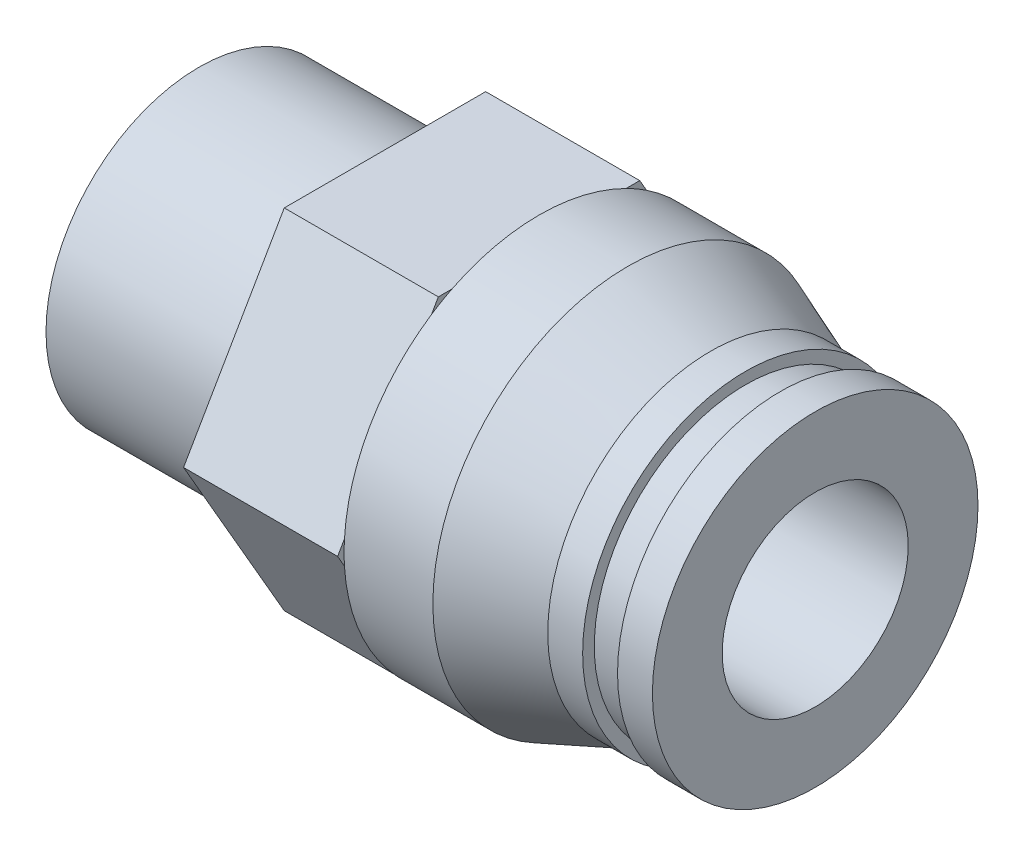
ISO-10303-21;
HEADER;
FILE_DESCRIPTION(('STEP AP214'),'2;1');
FILE_NAME('part.step','',(''),(''),'','','');
FILE_SCHEMA(('AUTOMOTIVE_DESIGN { 1 0 10303 214 1 1 1 1 }'));
ENDSEC;
DATA;
#1=APPLICATION_CONTEXT('core data for automotive mechanical design processes');
#2=APPLICATION_PROTOCOL_DEFINITION('international standard','automotive_design',2000,#1);
#3=PRODUCT_CONTEXT('',#1,'mechanical');
#4=PRODUCT('Part','Part','',(#3));
#5=PRODUCT_RELATED_PRODUCT_CATEGORY('part','',(#4));
#6=PRODUCT_DEFINITION_FORMATION('','',#4);
#7=PRODUCT_DEFINITION_CONTEXT('part definition',#1,'design');
#8=PRODUCT_DEFINITION('design','',#6,#7);
#9=PRODUCT_DEFINITION_SHAPE('','',#8);
#10=(LENGTH_UNIT() NAMED_UNIT(*) SI_UNIT(.MILLI.,.METRE.));
#11=(NAMED_UNIT(*) PLANE_ANGLE_UNIT() SI_UNIT($,.RADIAN.));
#12=(NAMED_UNIT(*) SI_UNIT($,.STERADIAN.) SOLID_ANGLE_UNIT());
#13=UNCERTAINTY_MEASURE_WITH_UNIT(LENGTH_MEASURE(1.E-05),#10,'distance_accuracy_value','');
#14=(GEOMETRIC_REPRESENTATION_CONTEXT(3) GLOBAL_UNCERTAINTY_ASSIGNED_CONTEXT((#13)) GLOBAL_UNIT_ASSIGNED_CONTEXT((#10,
#11,#12)) REPRESENTATION_CONTEXT('',''));
#15=CARTESIAN_POINT('',(0.,0.,0.));
#16=DIRECTION('',(0.,0.,1.));
#17=DIRECTION('',(1.,0.,0.));
#18=AXIS2_PLACEMENT_3D('',#15,#16,#17);
#19=CARTESIAN_POINT('',(8.,6.575,0.));
#20=DIRECTION('',(-1.,0.,0.));
#21=DIRECTION('',(0.,0.,1.));
#22=AXIS2_PLACEMENT_3D('',#19,#20,#21);
#23=PLANE('',#22);
#24=CARTESIAN_POINT('',(8.,0.,0.));
#25=DIRECTION('',(1.,0.,0.));
#26=DIRECTION('',(0.,0.,-1.));
#27=AXIS2_PLACEMENT_3D('',#24,#25,#26);
#28=CIRCLE('',#27,6.575);
#29=CARTESIAN_POINT('',(8.,0.,-6.575));
#30=VERTEX_POINT('',#29);
#31=EDGE_CURVE('E270',#30,#30,#28,.T.);
#32=ORIENTED_EDGE('',*,*,#31,.T.);
#33=EDGE_LOOP('',(#32));
#34=FACE_BOUND('',#33,.T.);
#35=DIRECTION('',(0.,-0.866025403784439,0.5));
#36=VECTOR('',#35,1.);
#37=CARTESIAN_POINT('',(8.,0.,-8.66025403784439));
#38=LINE('',#37,#36);
#39=CARTESIAN_POINT('',(8.,0.,-8.66025403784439));
#40=VERTEX_POINT('',#39);
#41=CARTESIAN_POINT('',(8.,-7.5,-4.33012701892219));
#42=VERTEX_POINT('',#41);
#43=EDGE_CURVE('E164',#40,#42,#38,.T.);
#44=ORIENTED_EDGE('',*,*,#43,.T.);
#45=DIRECTION('',(0.,0.,1.));
#46=VECTOR('',#45,1.);
#47=CARTESIAN_POINT('',(8.,-7.5,-4.33012701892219));
#48=LINE('',#47,#46);
#49=CARTESIAN_POINT('',(8.,-7.5,4.3301270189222));
#50=VERTEX_POINT('',#49);
#51=EDGE_CURVE('E146',#42,#50,#48,.T.);
#52=ORIENTED_EDGE('',*,*,#51,.T.);
#53=DIRECTION('',(0.,0.866025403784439,0.5));
#54=VECTOR('',#53,1.);
#55=CARTESIAN_POINT('',(8.,-7.5,4.3301270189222));
#56=LINE('',#55,#54);
#57=CARTESIAN_POINT('',(8.,0.,8.66025403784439));
#58=VERTEX_POINT('',#57);
#59=EDGE_CURVE('E158',#50,#58,#56,.T.);
#60=ORIENTED_EDGE('',*,*,#59,.T.);
#61=DIRECTION('',(0.,0.866025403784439,-0.5));
#62=VECTOR('',#61,1.);
#63=CARTESIAN_POINT('',(8.,0.,8.66025403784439));
#64=LINE('',#63,#62);
#65=CARTESIAN_POINT('',(8.,7.5,4.33012701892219));
#66=VERTEX_POINT('',#65);
#67=EDGE_CURVE('E30',#58,#66,#64,.T.);
#68=ORIENTED_EDGE('',*,*,#67,.T.);
#69=DIRECTION('',(0.,0.,-1.));
#70=VECTOR('',#69,1.);
#71=CARTESIAN_POINT('',(8.,7.5,4.33012701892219));
#72=LINE('',#71,#70);
#73=CARTESIAN_POINT('',(8.,7.5,-4.3301270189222));
#74=VERTEX_POINT('',#73);
#75=EDGE_CURVE('E168',#66,#74,#72,.T.);
#76=ORIENTED_EDGE('',*,*,#75,.T.);
#77=DIRECTION('',(0.,-0.866025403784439,-0.5));
#78=VECTOR('',#77,1.);
#79=CARTESIAN_POINT('',(8.,7.5,-4.3301270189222));
#80=LINE('',#79,#78);
#81=EDGE_CURVE('E171',#74,#40,#80,.T.);
#82=ORIENTED_EDGE('',*,*,#81,.T.);
#83=EDGE_LOOP('',(#44,#52,#60,#68,#76,#82));
#84=FACE_BOUND('',#83,.T.);
#85=ADVANCED_FACE('F15',(#34,#84),#23,.T.);
#86=CARTESIAN_POINT('',(14.625,9.5,0.));
#87=DIRECTION('',(1.,0.,0.));
#88=DIRECTION('',(0.,0.,-1.));
#89=AXIS2_PLACEMENT_3D('',#86,#87,#88);
#90=PLANE('',#89);
#91=CARTESIAN_POINT('',(14.625,0.,0.));
#92=DIRECTION('',(1.,0.,0.));
#93=DIRECTION('',(0.,0.,-1.));
#94=AXIS2_PLACEMENT_3D('',#91,#92,#93);
#95=CIRCLE('',#94,8.38207981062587);
#96=CARTESIAN_POINT('',(14.625,-7.5,-3.7428948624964));
#97=VERTEX_POINT('',#96);
#98=CARTESIAN_POINT('',(14.625,-6.99144203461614,-4.62374309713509));
#99=VERTEX_POINT('',#98);
#100=EDGE_CURVE('E381',#97,#99,#95,.T.);
#101=ORIENTED_EDGE('',*,*,#100,.F.);
#102=DIRECTION('',(0.,0.,1.));
#103=VECTOR('',#102,1.);
#104=CARTESIAN_POINT('',(14.625,-7.5,-4.33012701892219));
#105=LINE('',#104,#103);
#106=CARTESIAN_POINT('',(14.625,-7.5,-4.33012701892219));
#107=VERTEX_POINT('',#106);
#108=EDGE_CURVE('E174',#107,#97,#105,.T.);
#109=ORIENTED_EDGE('',*,*,#108,.F.);
#110=DIRECTION('',(0.,-0.866025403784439,0.5));
#111=VECTOR('',#110,1.);
#112=CARTESIAN_POINT('',(14.625,0.,-8.66025403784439));
#113=LINE('',#112,#111);
#114=EDGE_CURVE('E194',#99,#107,#113,.T.);
#115=ORIENTED_EDGE('',*,*,#114,.F.);
#116=EDGE_LOOP('',(#101,#109,#115));
#117=FACE_BOUND('',#116,.T.);
#118=ADVANCED_FACE('F325',(#117),#90,.T.);
#119=CARTESIAN_POINT('',(14.625,-0.508557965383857,-8.36663795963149));
#120=VERTEX_POINT('',#119);
#121=CARTESIAN_POINT('',(14.625,0.50855796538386,-8.36663795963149));
#122=VERTEX_POINT('',#121);
#123=EDGE_CURVE('E266',#120,#122,#95,.T.);
#124=ORIENTED_EDGE('',*,*,#123,.F.);
#125=CARTESIAN_POINT('',(14.625,0.,-8.66025403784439));
#126=VERTEX_POINT('',#125);
#127=EDGE_CURVE('E155',#126,#120,#113,.T.);
#128=ORIENTED_EDGE('',*,*,#127,.F.);
#129=DIRECTION('',(0.,-0.866025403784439,-0.5));
#130=VECTOR('',#129,1.);
#131=CARTESIAN_POINT('',(14.625,7.5,-4.3301270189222));
#132=LINE('',#131,#130);
#133=EDGE_CURVE('E189',#122,#126,#132,.T.);
#134=ORIENTED_EDGE('',*,*,#133,.F.);
#135=EDGE_LOOP('',(#124,#128,#134));
#136=FACE_BOUND('',#135,.T.);
#137=ADVANCED_FACE('F331',(#136),#90,.T.);
#138=CARTESIAN_POINT('',(14.625,6.99144203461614,-4.62374309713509));
#139=VERTEX_POINT('',#138);
#140=CARTESIAN_POINT('',(14.625,7.5,-3.74289486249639));
#141=VERTEX_POINT('',#140);
#142=EDGE_CURVE('E271',#139,#141,#95,.T.);
#143=ORIENTED_EDGE('',*,*,#142,.F.);
#144=CARTESIAN_POINT('',(14.625,7.5,-4.3301270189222));
#145=VERTEX_POINT('',#144);
#146=EDGE_CURVE('E191',#145,#139,#132,.T.);
#147=ORIENTED_EDGE('',*,*,#146,.F.);
#148=DIRECTION('',(0.,0.,-1.));
#149=VECTOR('',#148,1.);
#150=CARTESIAN_POINT('',(14.625,7.5,4.33012701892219));
#151=LINE('',#150,#149);
#152=EDGE_CURVE('E184',#141,#145,#151,.T.);
#153=ORIENTED_EDGE('',*,*,#152,.F.);
#154=EDGE_LOOP('',(#143,#147,#153));
#155=FACE_BOUND('',#154,.T.);
#156=ADVANCED_FACE('F443',(#155),#90,.T.);
#157=CARTESIAN_POINT('',(14.625,7.5,3.74289486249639));
#158=VERTEX_POINT('',#157);
#159=CARTESIAN_POINT('',(14.625,6.99144203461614,4.62374309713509));
#160=VERTEX_POINT('',#159);
#161=EDGE_CURVE('E378',#158,#160,#95,.T.);
#162=ORIENTED_EDGE('',*,*,#161,.F.);
#163=CARTESIAN_POINT('',(14.625,7.5,4.33012701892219));
#164=VERTEX_POINT('',#163);
#165=EDGE_CURVE('E186',#164,#158,#151,.T.);
#166=ORIENTED_EDGE('',*,*,#165,.F.);
#167=DIRECTION('',(0.,0.866025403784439,-0.5));
#168=VECTOR('',#167,1.);
#169=CARTESIAN_POINT('',(14.625,0.,8.66025403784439));
#170=LINE('',#169,#168);
#171=EDGE_CURVE('E181',#160,#164,#170,.T.);
#172=ORIENTED_EDGE('',*,*,#171,.F.);
#173=EDGE_LOOP('',(#162,#166,#172));
#174=FACE_BOUND('',#173,.T.);
#175=ADVANCED_FACE('F361',(#174),#90,.T.);
#176=CARTESIAN_POINT('',(14.625,0.508557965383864,8.36663795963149));
#177=VERTEX_POINT('',#176);
#178=CARTESIAN_POINT('',(14.625,-0.508557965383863,8.36663795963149));
#179=VERTEX_POINT('',#178);
#180=EDGE_CURVE('E372',#177,#179,#95,.T.);
#181=ORIENTED_EDGE('',*,*,#180,.F.);
#182=CARTESIAN_POINT('',(14.625,0.,8.66025403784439));
#183=VERTEX_POINT('',#182);
#184=EDGE_CURVE('E36',#183,#177,#170,.T.);
#185=ORIENTED_EDGE('',*,*,#184,.F.);
#186=DIRECTION('',(0.,0.866025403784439,0.5));
#187=VECTOR('',#186,1.);
#188=CARTESIAN_POINT('',(14.625,-7.5,4.3301270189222));
#189=LINE('',#188,#187);
#190=EDGE_CURVE('E177',#179,#183,#189,.T.);
#191=ORIENTED_EDGE('',*,*,#190,.F.);
#192=EDGE_LOOP('',(#181,#185,#191));
#193=FACE_BOUND('',#192,.T.);
#194=ADVANCED_FACE('F356',(#193),#90,.T.);
#195=CARTESIAN_POINT('',(14.625,-7.5,4.3301270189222));
#196=VERTEX_POINT('',#195);
#197=CARTESIAN_POINT('',(14.625,-6.99144203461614,4.62374309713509));
#198=VERTEX_POINT('',#197);
#199=EDGE_CURVE('E179',#196,#198,#189,.T.);
#200=ORIENTED_EDGE('',*,*,#199,.F.);
#201=CARTESIAN_POINT('',(14.625,-7.5,3.74289486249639));
#202=VERTEX_POINT('',#201);
#203=EDGE_CURVE('E150',#202,#196,#105,.T.);
#204=ORIENTED_EDGE('',*,*,#203,.F.);
#205=EDGE_CURVE('E365',#198,#202,#95,.T.);
#206=ORIENTED_EDGE('',*,*,#205,.F.);
#207=EDGE_LOOP('',(#200,#204,#206));
#208=FACE_BOUND('',#207,.T.);
#209=ADVANCED_FACE('F334',(#208),#90,.T.);
#210=CARTESIAN_POINT('',(0.,0.,0.));
#211=DIRECTION('',(-1.,0.,0.));
#212=DIRECTION('',(0.,0.,1.));
#213=AXIS2_PLACEMENT_3D('',#210,#211,#212);
#214=PLANE('',#213);
#215=CARTESIAN_POINT('',(0.,0.,0.));
#216=DIRECTION('',(1.,0.,0.));
#217=DIRECTION('',(0.,0.,-1.));
#218=AXIS2_PLACEMENT_3D('',#215,#216,#217);
#219=CIRCLE('',#218,6.575);
#220=CARTESIAN_POINT('',(0.,0.,-6.575));
#221=VERTEX_POINT('',#220);
#222=EDGE_CURVE('E274',#221,#221,#219,.T.);
#223=ORIENTED_EDGE('',*,*,#222,.F.);
#224=EDGE_LOOP('',(#223));
#225=FACE_BOUND('',#224,.T.);
#226=DIRECTION('',(0.,-0.866025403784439,-0.5));
#227=VECTOR('',#226,1.);
#228=CARTESIAN_POINT('',(0.,0.,3.46410161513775));
#229=LINE('',#228,#227);
#230=CARTESIAN_POINT('',(0.,0.,3.46410161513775));
#231=VERTEX_POINT('',#230);
#232=CARTESIAN_POINT('',(0.,-3.,1.73205080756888));
#233=VERTEX_POINT('',#232);
#234=EDGE_CURVE('E223',#231,#233,#229,.T.);
#235=ORIENTED_EDGE('',*,*,#234,.T.);
#236=DIRECTION('',(0.,0.,-1.));
#237=VECTOR('',#236,1.);
#238=CARTESIAN_POINT('',(0.,-3.,1.73205080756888));
#239=LINE('',#238,#237);
#240=CARTESIAN_POINT('',(0.,-3.,-1.73205080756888));
#241=VERTEX_POINT('',#240);
#242=EDGE_CURVE('E201',#233,#241,#239,.T.);
#243=ORIENTED_EDGE('',*,*,#242,.T.);
#244=DIRECTION('',(0.,0.866025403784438,-0.5));
#245=VECTOR('',#244,1.);
#246=CARTESIAN_POINT('',(0.,-3.,-1.73205080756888));
#247=LINE('',#246,#245);
#248=CARTESIAN_POINT('',(0.,0.,-3.46410161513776));
#249=VERTEX_POINT('',#248);
#250=EDGE_CURVE('E211',#241,#249,#247,.T.);
#251=ORIENTED_EDGE('',*,*,#250,.T.);
#252=DIRECTION('',(0.,0.866025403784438,0.5));
#253=VECTOR('',#252,1.);
#254=CARTESIAN_POINT('',(0.,0.,-3.46410161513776));
#255=LINE('',#254,#253);
#256=CARTESIAN_POINT('',(0.,3.,-1.73205080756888));
#257=VERTEX_POINT('',#256);
#258=EDGE_CURVE('E214',#249,#257,#255,.T.);
#259=ORIENTED_EDGE('',*,*,#258,.T.);
#260=DIRECTION('',(0.,0.,1.));
#261=VECTOR('',#260,1.);
#262=CARTESIAN_POINT('',(0.,3.,-1.73205080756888));
#263=LINE('',#262,#261);
#264=CARTESIAN_POINT('',(0.,3.,1.73205080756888));
#265=VERTEX_POINT('',#264);
#266=EDGE_CURVE('E217',#257,#265,#263,.T.);
#267=ORIENTED_EDGE('',*,*,#266,.T.);
#268=DIRECTION('',(0.,-0.866025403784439,0.5));
#269=VECTOR('',#268,1.);
#270=CARTESIAN_POINT('',(0.,3.,1.73205080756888));
#271=LINE('',#270,#269);
#272=EDGE_CURVE('E220',#265,#231,#271,.T.);
#273=ORIENTED_EDGE('',*,*,#272,.T.);
#274=EDGE_LOOP('',(#235,#243,#251,#259,#267,#273));
#275=FACE_BOUND('',#274,.T.);
#276=ADVANCED_FACE('F17',(#225,#275),#214,.T.);
#277=CARTESIAN_POINT('',(9.,4.,0.));
#278=DIRECTION('',(1.,0.,0.));
#279=DIRECTION('',(0.,0.,-1.));
#280=AXIS2_PLACEMENT_3D('',#277,#278,#279);
#281=PLANE('',#280);
#282=CARTESIAN_POINT('',(9.,0.,0.));
#283=DIRECTION('',(1.,0.,0.));
#284=DIRECTION('',(0.,0.,-1.));
#285=AXIS2_PLACEMENT_3D('',#282,#283,#284);
#286=CIRCLE('',#285,4.);
#287=CARTESIAN_POINT('',(9.,0.,-4.));
#288=VERTEX_POINT('',#287);
#289=EDGE_CURVE('E239',#288,#288,#286,.T.);
#290=ORIENTED_EDGE('',*,*,#289,.T.);
#291=EDGE_LOOP('',(#290));
#292=FACE_BOUND('',#291,.T.);
#293=DIRECTION('',(0.,-0.866025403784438,0.5));
#294=VECTOR('',#293,1.);
#295=CARTESIAN_POINT('',(9.,1.5,-4.3301270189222));
#296=LINE('',#295,#294);
#297=CARTESIAN_POINT('',(9.,0.,-3.46410161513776));
#298=VERTEX_POINT('',#297);
#299=CARTESIAN_POINT('',(9.,-3.,-1.73205080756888));
#300=VERTEX_POINT('',#299);
#301=EDGE_CURVE('E23',#298,#300,#296,.T.);
#302=ORIENTED_EDGE('',*,*,#301,.T.);
#303=DIRECTION('',(0.,0.,1.));
#304=VECTOR('',#303,1.);
#305=CARTESIAN_POINT('',(9.,-3.,0.));
#306=LINE('',#305,#304);
#307=CARTESIAN_POINT('',(9.,-3.,1.73205080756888));
#308=VERTEX_POINT('',#307);
#309=EDGE_CURVE('E9',#300,#308,#306,.T.);
#310=ORIENTED_EDGE('',*,*,#309,.T.);
#311=DIRECTION('',(0.,0.866025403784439,0.5));
#312=VECTOR('',#311,1.);
#313=CARTESIAN_POINT('',(9.,1.5,4.33012701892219));
#314=LINE('',#313,#312);
#315=CARTESIAN_POINT('',(9.,0.,3.46410161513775));
#316=VERTEX_POINT('',#315);
#317=EDGE_CURVE('E277',#308,#316,#314,.T.);
#318=ORIENTED_EDGE('',*,*,#317,.T.);
#319=DIRECTION('',(0.,0.866025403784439,-0.5));
#320=VECTOR('',#319,1.);
#321=CARTESIAN_POINT('',(9.,4.5,0.866025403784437));
#322=LINE('',#321,#320);
#323=CARTESIAN_POINT('',(9.,3.,1.73205080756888));
#324=VERTEX_POINT('',#323);
#325=EDGE_CURVE('E280',#316,#324,#322,.T.);
#326=ORIENTED_EDGE('',*,*,#325,.T.);
#327=DIRECTION('',(0.,0.,-1.));
#328=VECTOR('',#327,1.);
#329=CARTESIAN_POINT('',(9.,3.,0.));
#330=LINE('',#329,#328);
#331=CARTESIAN_POINT('',(9.,3.,-1.73205080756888));
#332=VERTEX_POINT('',#331);
#333=EDGE_CURVE('E283',#324,#332,#330,.T.);
#334=ORIENTED_EDGE('',*,*,#333,.T.);
#335=DIRECTION('',(0.,-0.866025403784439,-0.5));
#336=VECTOR('',#335,1.);
#337=CARTESIAN_POINT('',(9.,4.5,-0.866025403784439));
#338=LINE('',#337,#336);
#339=EDGE_CURVE('E286',#332,#298,#338,.T.);
#340=ORIENTED_EDGE('',*,*,#339,.T.);
#341=EDGE_LOOP('',(#302,#310,#318,#326,#334,#340));
#342=FACE_BOUND('',#341,.T.);
#343=ADVANCED_FACE('F290',(#292,#342),#281,.T.);
#344=CARTESIAN_POINT('',(0.,0.,0.));
#345=DIRECTION('',(1.,0.,0.));
#346=DIRECTION('',(0.,0.,-1.));
#347=AXIS2_PLACEMENT_3D('',#344,#345,#346);
#348=CYLINDRICAL_SURFACE('',#347,6.575);
#349=ORIENTED_EDGE('',*,*,#222,.T.);
#350=EDGE_LOOP('',(#349));
#351=FACE_BOUND('',#350,.T.);
#352=ORIENTED_EDGE('',*,*,#31,.F.);
#353=EDGE_LOOP('',(#352));
#354=FACE_BOUND('',#353,.T.);
#355=ADVANCED_FACE('F336',(#351,#354),#348,.T.);
#356=CARTESIAN_POINT('',(0.,0.,0.));
#357=DIRECTION('',(1.,0.,0.));
#358=DIRECTION('',(0.,0.,-1.));
#359=AXIS2_PLACEMENT_3D('',#356,#357,#358);
#360=CYLINDRICAL_SURFACE('',#359,8.38207981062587);
#361=EDGE_CURVE('E267',#122,#139,#95,.T.);
#362=ORIENTED_EDGE('',*,*,#361,.T.);
#363=ORIENTED_EDGE('',*,*,#142,.T.);
#364=EDGE_CURVE('E445',#141,#158,#95,.T.);
#365=ORIENTED_EDGE('',*,*,#364,.T.);
#366=ORIENTED_EDGE('',*,*,#161,.T.);
#367=EDGE_CURVE('E377',#160,#177,#95,.T.);
#368=ORIENTED_EDGE('',*,*,#367,.T.);
#369=ORIENTED_EDGE('',*,*,#180,.T.);
#370=EDGE_CURVE('E375',#179,#198,#95,.T.);
#371=ORIENTED_EDGE('',*,*,#370,.T.);
#372=ORIENTED_EDGE('',*,*,#205,.T.);
#373=EDGE_CURVE('E379',#202,#97,#95,.T.);
#374=ORIENTED_EDGE('',*,*,#373,.T.);
#375=ORIENTED_EDGE('',*,*,#100,.T.);
#376=EDGE_CURVE('E383',#99,#120,#95,.T.);
#377=ORIENTED_EDGE('',*,*,#376,.T.);
#378=ORIENTED_EDGE('',*,*,#123,.T.);
#379=EDGE_LOOP('',(#362,#363,#365,#366,#368,#369,#371,#372,#374,#375,#377,#378));
#380=FACE_BOUND('',#379,.T.);
#381=CARTESIAN_POINT('',(18.4420013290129,0.,0.));
#382=DIRECTION('',(1.,0.,0.));
#383=DIRECTION('',(0.,0.,-1.));
#384=AXIS2_PLACEMENT_3D('',#381,#382,#383);
#385=CIRCLE('',#384,8.38207981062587);
#386=CARTESIAN_POINT('',(18.4420013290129,0.,-8.38207981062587));
#387=VERTEX_POINT('',#386);
#388=EDGE_CURVE('E263',#387,#387,#385,.T.);
#389=ORIENTED_EDGE('',*,*,#388,.F.);
#390=EDGE_LOOP('',(#389));
#391=FACE_BOUND('',#390,.T.);
#392=ADVANCED_FACE('F338',(#380,#391),#360,.T.);
#393=CARTESIAN_POINT('',(22.,0.,0.));
#394=DIRECTION('',(-1.,0.,0.));
#395=DIRECTION('',(0.,0.,1.));
#396=AXIS2_PLACEMENT_3D('',#393,#394,#395);
#397=CONICAL_SURFACE('',#396,7.,0.370503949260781);
#398=ORIENTED_EDGE('',*,*,#388,.T.);
#399=EDGE_LOOP('',(#398));
#400=FACE_BOUND('',#399,.T.);
#401=CARTESIAN_POINT('',(22.,0.,0.));
#402=DIRECTION('',(1.,0.,0.));
#403=DIRECTION('',(0.,0.,-1.));
#404=AXIS2_PLACEMENT_3D('',#401,#402,#403);
#405=CIRCLE('',#404,7.);
#406=CARTESIAN_POINT('',(22.,0.,-7.));
#407=VERTEX_POINT('',#406);
#408=EDGE_CURVE('E260',#407,#407,#405,.T.);
#409=ORIENTED_EDGE('',*,*,#408,.F.);
#410=EDGE_LOOP('',(#409));
#411=FACE_BOUND('',#410,.T.);
#412=ADVANCED_FACE('F344',(#400,#411),#397,.T.);
#413=CARTESIAN_POINT('',(0.,0.,0.));
#414=DIRECTION('',(1.,0.,0.));
#415=DIRECTION('',(0.,0.,-1.));
#416=AXIS2_PLACEMENT_3D('',#413,#414,#415);
#417=CYLINDRICAL_SURFACE('',#416,7.);
#418=ORIENTED_EDGE('',*,*,#408,.T.);
#419=EDGE_LOOP('',(#418));
#420=FACE_BOUND('',#419,.T.);
#421=CARTESIAN_POINT('',(23.5,0.,0.));
#422=DIRECTION('',(1.,0.,0.));
#423=DIRECTION('',(0.,0.,-1.));
#424=AXIS2_PLACEMENT_3D('',#421,#422,#423);
#425=CIRCLE('',#424,7.);
#426=CARTESIAN_POINT('',(23.5,0.,-7.));
#427=VERTEX_POINT('',#426);
#428=EDGE_CURVE('E257',#427,#427,#425,.T.);
#429=ORIENTED_EDGE('',*,*,#428,.F.);
#430=EDGE_LOOP('',(#429));
#431=FACE_BOUND('',#430,.T.);
#432=ADVANCED_FACE('F606',(#420,#431),#417,.T.);
#433=CARTESIAN_POINT('',(23.5,7.,0.));
#434=DIRECTION('',(1.,0.,0.));
#435=DIRECTION('',(0.,0.,-1.));
#436=AXIS2_PLACEMENT_3D('',#433,#434,#435);
#437=PLANE('',#436);
#438=ORIENTED_EDGE('',*,*,#428,.T.);
#439=EDGE_LOOP('',(#438));
#440=FACE_BOUND('',#439,.T.);
#441=CARTESIAN_POINT('',(23.5,0.,0.));
#442=DIRECTION('',(1.,0.,0.));
#443=DIRECTION('',(0.,0.,-1.));
#444=AXIS2_PLACEMENT_3D('',#441,#442,#443);
#445=CIRCLE('',#444,6.5);
#446=CARTESIAN_POINT('',(23.5,0.,-6.5));
#447=VERTEX_POINT('',#446);
#448=EDGE_CURVE('E254',#447,#447,#445,.T.);
#449=ORIENTED_EDGE('',*,*,#448,.F.);
#450=EDGE_LOOP('',(#449));
#451=FACE_BOUND('',#450,.T.);
#452=ADVANCED_FACE('F596',(#440,#451),#437,.T.);
#453=CARTESIAN_POINT('',(0.,0.,0.));
#454=DIRECTION('',(1.,0.,0.));
#455=DIRECTION('',(0.,0.,-1.));
#456=AXIS2_PLACEMENT_3D('',#453,#454,#455);
#457=CYLINDRICAL_SURFACE('',#456,6.5);
#458=ORIENTED_EDGE('',*,*,#448,.T.);
#459=EDGE_LOOP('',(#458));
#460=FACE_BOUND('',#459,.T.);
#461=CARTESIAN_POINT('',(25.,0.,0.));
#462=DIRECTION('',(1.,0.,0.));
#463=DIRECTION('',(0.,0.,-1.));
#464=AXIS2_PLACEMENT_3D('',#461,#462,#463);
#465=CIRCLE('',#464,6.5);
#466=CARTESIAN_POINT('',(25.,0.,-6.5));
#467=VERTEX_POINT('',#466);
#468=EDGE_CURVE('E251',#467,#467,#465,.T.);
#469=ORIENTED_EDGE('',*,*,#468,.F.);
#470=EDGE_LOOP('',(#469));
#471=FACE_BOUND('',#470,.T.);
#472=ADVANCED_FACE('F586',(#460,#471),#457,.T.);
#473=CARTESIAN_POINT('',(25.,6.5,0.));
#474=DIRECTION('',(-1.,0.,0.));
#475=DIRECTION('',(0.,0.,1.));
#476=AXIS2_PLACEMENT_3D('',#473,#474,#475);
#477=PLANE('',#476);
#478=ORIENTED_EDGE('',*,*,#468,.T.);
#479=EDGE_LOOP('',(#478));
#480=FACE_BOUND('',#479,.T.);
#481=CARTESIAN_POINT('',(25.,0.,0.));
#482=DIRECTION('',(1.,0.,0.));
#483=DIRECTION('',(0.,0.,-1.));
#484=AXIS2_PLACEMENT_3D('',#481,#482,#483);
#485=CIRCLE('',#484,7.);
#486=CARTESIAN_POINT('',(25.,0.,-7.));
#487=VERTEX_POINT('',#486);
#488=EDGE_CURVE('E248',#487,#487,#485,.T.);
#489=ORIENTED_EDGE('',*,*,#488,.F.);
#490=EDGE_LOOP('',(#489));
#491=FACE_BOUND('',#490,.T.);
#492=ADVANCED_FACE('F574',(#480,#491),#477,.T.);
#493=CARTESIAN_POINT('',(0.,0.,0.));
#494=DIRECTION('',(1.,0.,0.));
#495=DIRECTION('',(0.,0.,-1.));
#496=AXIS2_PLACEMENT_3D('',#493,#494,#495);
#497=CYLINDRICAL_SURFACE('',#496,7.);
#498=ORIENTED_EDGE('',*,*,#488,.T.);
#499=EDGE_LOOP('',(#498));
#500=FACE_BOUND('',#499,.T.);
#501=CARTESIAN_POINT('',(26.5,0.,0.));
#502=DIRECTION('',(1.,0.,0.));
#503=DIRECTION('',(0.,0.,-1.));
#504=AXIS2_PLACEMENT_3D('',#501,#502,#503);
#505=CIRCLE('',#504,7.);
#506=CARTESIAN_POINT('',(26.5,0.,-7.));
#507=VERTEX_POINT('',#506);
#508=EDGE_CURVE('E245',#507,#507,#505,.T.);
#509=ORIENTED_EDGE('',*,*,#508,.F.);
#510=EDGE_LOOP('',(#509));
#511=FACE_BOUND('',#510,.T.);
#512=ADVANCED_FACE('F564',(#500,#511),#497,.T.);
#513=CARTESIAN_POINT('',(26.5,7.,0.));
#514=DIRECTION('',(1.,0.,0.));
#515=DIRECTION('',(0.,0.,-1.));
#516=AXIS2_PLACEMENT_3D('',#513,#514,#515);
#517=PLANE('',#516);
#518=ORIENTED_EDGE('',*,*,#508,.T.);
#519=EDGE_LOOP('',(#518));
#520=FACE_BOUND('',#519,.T.);
#521=CARTESIAN_POINT('',(26.5,0.,0.));
#522=DIRECTION('',(1.,0.,0.));
#523=DIRECTION('',(0.,0.,-1.));
#524=AXIS2_PLACEMENT_3D('',#521,#522,#523);
#525=CIRCLE('',#524,4.);
#526=CARTESIAN_POINT('',(26.5,0.,-4.));
#527=VERTEX_POINT('',#526);
#528=EDGE_CURVE('E242',#527,#527,#525,.T.);
#529=ORIENTED_EDGE('',*,*,#528,.F.);
#530=EDGE_LOOP('',(#529));
#531=FACE_BOUND('',#530,.T.);
#532=ADVANCED_FACE('F551',(#520,#531),#517,.T.);
#533=CARTESIAN_POINT('',(0.,0.,0.));
#534=DIRECTION('',(1.,0.,0.));
#535=DIRECTION('',(0.,0.,-1.));
#536=AXIS2_PLACEMENT_3D('',#533,#534,#535);
#537=CYLINDRICAL_SURFACE('',#536,4.);
#538=ORIENTED_EDGE('',*,*,#528,.T.);
#539=EDGE_LOOP('',(#538));
#540=FACE_BOUND('',#539,.T.);
#541=ORIENTED_EDGE('',*,*,#289,.F.);
#542=EDGE_LOOP('',(#541));
#543=FACE_BOUND('',#542,.T.);
#544=ADVANCED_FACE('F541',(#540,#543),#537,.F.);
#545=CARTESIAN_POINT('',(26.5,-3.,1.73205080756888));
#546=DIRECTION('',(0.,1.,0.));
#547=DIRECTION('',(0.,0.,1.));
#548=AXIS2_PLACEMENT_3D('',#545,#546,#547);
#549=PLANE('',#548);
#550=DIRECTION('',(-1.,0.,0.));
#551=VECTOR('',#550,1.);
#552=CARTESIAN_POINT('',(26.5,-3.,-1.73205080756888));
#553=LINE('',#552,#551);
#554=EDGE_CURVE('E237',#300,#241,#553,.T.);
#555=ORIENTED_EDGE('',*,*,#554,.T.);
#556=ORIENTED_EDGE('',*,*,#242,.F.);
#557=DIRECTION('',(-1.,0.,0.));
#558=VECTOR('',#557,1.);
#559=CARTESIAN_POINT('',(26.5,-3.,1.73205080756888));
#560=LINE('',#559,#558);
#561=EDGE_CURVE('E226',#308,#233,#560,.T.);
#562=ORIENTED_EDGE('',*,*,#561,.F.);
#563=ORIENTED_EDGE('',*,*,#309,.F.);
#564=EDGE_LOOP('',(#555,#556,#562,#563));
#565=FACE_BOUND('',#564,.T.);
#566=ADVANCED_FACE('F305',(#565),#549,.T.);
#567=CARTESIAN_POINT('',(26.5,-3.,-1.73205080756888));
#568=DIRECTION('',(0.,0.5,0.866025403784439));
#569=DIRECTION('',(0.,-0.866025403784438,0.5));
#570=AXIS2_PLACEMENT_3D('',#567,#568,#569);
#571=PLANE('',#570);
#572=DIRECTION('',(-1.,0.,0.));
#573=VECTOR('',#572,1.);
#574=CARTESIAN_POINT('',(26.5,0.,-3.46410161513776));
#575=LINE('',#574,#573);
#576=EDGE_CURVE('E235',#298,#249,#575,.T.);
#577=ORIENTED_EDGE('',*,*,#576,.T.);
#578=ORIENTED_EDGE('',*,*,#250,.F.);
#579=ORIENTED_EDGE('',*,*,#554,.F.);
#580=ORIENTED_EDGE('',*,*,#301,.F.);
#581=EDGE_LOOP('',(#577,#578,#579,#580));
#582=FACE_BOUND('',#581,.T.);
#583=ADVANCED_FACE('F294',(#582),#571,.T.);
#584=CARTESIAN_POINT('',(26.5,0.,-3.46410161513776));
#585=DIRECTION('',(0.,-0.5,0.866025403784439));
#586=DIRECTION('',(0.,-0.866025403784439,-0.5));
#587=AXIS2_PLACEMENT_3D('',#584,#585,#586);
#588=PLANE('',#587);
#589=DIRECTION('',(-1.,0.,0.));
#590=VECTOR('',#589,1.);
#591=CARTESIAN_POINT('',(26.5,3.,-1.73205080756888));
#592=LINE('',#591,#590);
#593=EDGE_CURVE('E233',#332,#257,#592,.T.);
#594=ORIENTED_EDGE('',*,*,#593,.T.);
#595=ORIENTED_EDGE('',*,*,#258,.F.);
#596=ORIENTED_EDGE('',*,*,#576,.F.);
#597=ORIENTED_EDGE('',*,*,#339,.F.);
#598=EDGE_LOOP('',(#594,#595,#596,#597));
#599=FACE_BOUND('',#598,.T.);
#600=ADVANCED_FACE('F298',(#599),#588,.T.);
#601=CARTESIAN_POINT('',(26.5,3.,-1.73205080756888));
#602=DIRECTION('',(0.,-1.,0.));
#603=DIRECTION('',(0.,0.,-1.));
#604=AXIS2_PLACEMENT_3D('',#601,#602,#603);
#605=PLANE('',#604);
#606=DIRECTION('',(-1.,0.,0.));
#607=VECTOR('',#606,1.);
#608=CARTESIAN_POINT('',(26.5,3.,1.73205080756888));
#609=LINE('',#608,#607);
#610=EDGE_CURVE('E231',#324,#265,#609,.T.);
#611=ORIENTED_EDGE('',*,*,#610,.T.);
#612=ORIENTED_EDGE('',*,*,#266,.F.);
#613=ORIENTED_EDGE('',*,*,#593,.F.);
#614=ORIENTED_EDGE('',*,*,#333,.F.);
#615=EDGE_LOOP('',(#611,#612,#613,#614));
#616=FACE_BOUND('',#615,.T.);
#617=ADVANCED_FACE('F314',(#616),#605,.T.);
#618=CARTESIAN_POINT('',(26.5,3.,1.73205080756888));
#619=DIRECTION('',(0.,-0.5,-0.866025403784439));
#620=DIRECTION('',(0.,0.866025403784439,-0.5));
#621=AXIS2_PLACEMENT_3D('',#618,#619,#620);
#622=PLANE('',#621);
#623=DIRECTION('',(-1.,0.,0.));
#624=VECTOR('',#623,1.);
#625=CARTESIAN_POINT('',(26.5,0.,3.46410161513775));
#626=LINE('',#625,#624);
#627=EDGE_CURVE('E229',#316,#231,#626,.T.);
#628=ORIENTED_EDGE('',*,*,#627,.T.);
#629=ORIENTED_EDGE('',*,*,#272,.F.);
#630=ORIENTED_EDGE('',*,*,#610,.F.);
#631=ORIENTED_EDGE('',*,*,#325,.F.);
#632=EDGE_LOOP('',(#628,#629,#630,#631));
#633=FACE_BOUND('',#632,.T.);
#634=ADVANCED_FACE('F311',(#633),#622,.T.);
#635=CARTESIAN_POINT('',(26.5,0.,3.46410161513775));
#636=DIRECTION('',(0.,0.5,-0.866025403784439));
#637=DIRECTION('',(0.,0.866025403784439,0.5));
#638=AXIS2_PLACEMENT_3D('',#635,#636,#637);
#639=PLANE('',#638);
#640=ORIENTED_EDGE('',*,*,#561,.T.);
#641=ORIENTED_EDGE('',*,*,#234,.F.);
#642=ORIENTED_EDGE('',*,*,#627,.F.);
#643=ORIENTED_EDGE('',*,*,#317,.F.);
#644=EDGE_LOOP('',(#640,#641,#642,#643));
#645=FACE_BOUND('',#644,.T.);
#646=ADVANCED_FACE('F307',(#645),#639,.T.);
#647=CARTESIAN_POINT('',(14.625,0.,0.));
#648=DIRECTION('',(-1.,0.,0.));
#649=DIRECTION('',(0.,0.,1.));
#650=AXIS2_PLACEMENT_3D('',#647,#648,#649);
#651=PLANE('',#650);
#652=EDGE_CURVE('E182',#198,#179,#189,.T.);
#653=ORIENTED_EDGE('',*,*,#652,.F.);
#654=ORIENTED_EDGE('',*,*,#370,.F.);
#655=EDGE_LOOP('',(#653,#654));
#656=FACE_BOUND('',#655,.T.);
#657=ADVANCED_FACE('F417',(#656),#651,.T.);
#658=EDGE_CURVE('E178',#97,#202,#105,.T.);
#659=ORIENTED_EDGE('',*,*,#658,.F.);
#660=ORIENTED_EDGE('',*,*,#373,.F.);
#661=EDGE_LOOP('',(#659,#660));
#662=FACE_BOUND('',#661,.T.);
#663=ADVANCED_FACE('F411',(#662),#651,.T.);
#664=EDGE_CURVE('E198',#120,#99,#113,.T.);
#665=ORIENTED_EDGE('',*,*,#664,.F.);
#666=ORIENTED_EDGE('',*,*,#376,.F.);
#667=EDGE_LOOP('',(#665,#666));
#668=FACE_BOUND('',#667,.T.);
#669=ADVANCED_FACE('F403',(#668),#651,.T.);
#670=EDGE_CURVE('E195',#139,#122,#132,.T.);
#671=ORIENTED_EDGE('',*,*,#670,.F.);
#672=ORIENTED_EDGE('',*,*,#361,.F.);
#673=EDGE_LOOP('',(#671,#672));
#674=FACE_BOUND('',#673,.T.);
#675=ADVANCED_FACE('F400',(#674),#651,.T.);
#676=EDGE_CURVE('E190',#158,#141,#151,.T.);
#677=ORIENTED_EDGE('',*,*,#676,.F.);
#678=ORIENTED_EDGE('',*,*,#364,.F.);
#679=EDGE_LOOP('',(#677,#678));
#680=FACE_BOUND('',#679,.T.);
#681=ADVANCED_FACE('F402',(#680),#651,.T.);
#682=EDGE_CURVE('E185',#177,#160,#170,.T.);
#683=ORIENTED_EDGE('',*,*,#682,.F.);
#684=ORIENTED_EDGE('',*,*,#367,.F.);
#685=EDGE_LOOP('',(#683,#684));
#686=FACE_BOUND('',#685,.T.);
#687=ADVANCED_FACE('F409',(#686),#651,.T.);
#688=CARTESIAN_POINT('',(14.625,-7.5,-4.33012701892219));
#689=DIRECTION('',(0.,-1.,0.));
#690=DIRECTION('',(0.,0.,-1.));
#691=AXIS2_PLACEMENT_3D('',#688,#689,#690);
#692=PLANE('',#691);
#693=DIRECTION('',(-1.,0.,0.));
#694=VECTOR('',#693,1.);
#695=CARTESIAN_POINT('',(14.625,-7.5,-4.33012701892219));
#696=LINE('',#695,#694);
#697=EDGE_CURVE('E199',#107,#42,#696,.T.);
#698=ORIENTED_EDGE('',*,*,#697,.F.);
#699=ORIENTED_EDGE('',*,*,#108,.T.);
#700=ORIENTED_EDGE('',*,*,#658,.T.);
#701=ORIENTED_EDGE('',*,*,#203,.T.);
#702=DIRECTION('',(-1.,0.,0.));
#703=VECTOR('',#702,1.);
#704=CARTESIAN_POINT('',(14.625,-7.5,4.3301270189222));
#705=LINE('',#704,#703);
#706=EDGE_CURVE('E141',#196,#50,#705,.T.);
#707=ORIENTED_EDGE('',*,*,#706,.T.);
#708=ORIENTED_EDGE('',*,*,#51,.F.);
#709=EDGE_LOOP('',(#698,#699,#700,#701,#707,#708));
#710=FACE_BOUND('',#709,.T.);
#711=ADVANCED_FACE('F144',(#710),#692,.T.);
#712=CARTESIAN_POINT('',(14.625,0.,-8.66025403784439));
#713=DIRECTION('',(0.,-0.5,-0.866025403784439));
#714=DIRECTION('',(0.,0.866025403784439,-0.5));
#715=AXIS2_PLACEMENT_3D('',#712,#713,#714);
#716=PLANE('',#715);
#717=DIRECTION('',(-1.,0.,0.));
#718=VECTOR('',#717,1.);
#719=CARTESIAN_POINT('',(14.625,0.,-8.66025403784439));
#720=LINE('',#719,#718);
#721=EDGE_CURVE('E202',#126,#40,#720,.T.);
#722=ORIENTED_EDGE('',*,*,#721,.F.);
#723=ORIENTED_EDGE('',*,*,#127,.T.);
#724=ORIENTED_EDGE('',*,*,#664,.T.);
#725=ORIENTED_EDGE('',*,*,#114,.T.);
#726=ORIENTED_EDGE('',*,*,#697,.T.);
#727=ORIENTED_EDGE('',*,*,#43,.F.);
#728=EDGE_LOOP('',(#722,#723,#724,#725,#726,#727));
#729=FACE_BOUND('',#728,.T.);
#730=ADVANCED_FACE('F433',(#729),#716,.T.);
#731=CARTESIAN_POINT('',(14.625,7.5,-4.3301270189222));
#732=DIRECTION('',(0.,0.5,-0.866025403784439));
#733=DIRECTION('',(0.,0.866025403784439,0.5));
#734=AXIS2_PLACEMENT_3D('',#731,#732,#733);
#735=PLANE('',#734);
#736=DIRECTION('',(-1.,0.,0.));
#737=VECTOR('',#736,1.);
#738=CARTESIAN_POINT('',(14.625,7.5,-4.3301270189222));
#739=LINE('',#738,#737);
#740=EDGE_CURVE('E204',#145,#74,#739,.T.);
#741=ORIENTED_EDGE('',*,*,#740,.F.);
#742=ORIENTED_EDGE('',*,*,#146,.T.);
#743=ORIENTED_EDGE('',*,*,#670,.T.);
#744=ORIENTED_EDGE('',*,*,#133,.T.);
#745=ORIENTED_EDGE('',*,*,#721,.T.);
#746=ORIENTED_EDGE('',*,*,#81,.F.);
#747=EDGE_LOOP('',(#741,#742,#743,#744,#745,#746));
#748=FACE_BOUND('',#747,.T.);
#749=ADVANCED_FACE('F396',(#748),#735,.T.);
#750=CARTESIAN_POINT('',(14.625,7.5,4.33012701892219));
#751=DIRECTION('',(0.,1.,0.));
#752=DIRECTION('',(0.,0.,1.));
#753=AXIS2_PLACEMENT_3D('',#750,#751,#752);
#754=PLANE('',#753);
#755=DIRECTION('',(-1.,0.,0.));
#756=VECTOR('',#755,1.);
#757=CARTESIAN_POINT('',(14.625,7.5,4.33012701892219));
#758=LINE('',#757,#756);
#759=EDGE_CURVE('E206',#164,#66,#758,.T.);
#760=ORIENTED_EDGE('',*,*,#759,.F.);
#761=ORIENTED_EDGE('',*,*,#165,.T.);
#762=ORIENTED_EDGE('',*,*,#676,.T.);
#763=ORIENTED_EDGE('',*,*,#152,.T.);
#764=ORIENTED_EDGE('',*,*,#740,.T.);
#765=ORIENTED_EDGE('',*,*,#75,.F.);
#766=EDGE_LOOP('',(#760,#761,#762,#763,#764,#765));
#767=FACE_BOUND('',#766,.T.);
#768=ADVANCED_FACE('F438',(#767),#754,.T.);
#769=CARTESIAN_POINT('',(14.625,0.,8.66025403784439));
#770=DIRECTION('',(0.,0.5,0.866025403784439));
#771=DIRECTION('',(0.,-0.866025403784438,0.5));
#772=AXIS2_PLACEMENT_3D('',#769,#770,#771);
#773=PLANE('',#772);
#774=DIRECTION('',(-1.,0.,0.));
#775=VECTOR('',#774,1.);
#776=CARTESIAN_POINT('',(14.625,0.,8.66025403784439));
#777=LINE('',#776,#775);
#778=EDGE_CURVE('E154',#183,#58,#777,.T.);
#779=ORIENTED_EDGE('',*,*,#778,.F.);
#780=ORIENTED_EDGE('',*,*,#184,.T.);
#781=ORIENTED_EDGE('',*,*,#682,.T.);
#782=ORIENTED_EDGE('',*,*,#171,.T.);
#783=ORIENTED_EDGE('',*,*,#759,.T.);
#784=ORIENTED_EDGE('',*,*,#67,.F.);
#785=EDGE_LOOP('',(#779,#780,#781,#782,#783,#784));
#786=FACE_BOUND('',#785,.T.);
#787=ADVANCED_FACE('F449',(#786),#773,.T.);
#788=CARTESIAN_POINT('',(14.625,-7.5,4.3301270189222));
#789=DIRECTION('',(0.,-0.5,0.866025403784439));
#790=DIRECTION('',(0.,-0.866025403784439,-0.5));
#791=AXIS2_PLACEMENT_3D('',#788,#789,#790);
#792=PLANE('',#791);
#793=ORIENTED_EDGE('',*,*,#706,.F.);
#794=ORIENTED_EDGE('',*,*,#199,.T.);
#795=ORIENTED_EDGE('',*,*,#652,.T.);
#796=ORIENTED_EDGE('',*,*,#190,.T.);
#797=ORIENTED_EDGE('',*,*,#778,.T.);
#798=ORIENTED_EDGE('',*,*,#59,.F.);
#799=EDGE_LOOP('',(#793,#794,#795,#796,#797,#798));
#800=FACE_BOUND('',#799,.T.);
#801=ADVANCED_FACE('F159',(#800),#792,.T.);
#802=CLOSED_SHELL('',(#85,#118,#137,#156,#175,#194,#209,#276,#343,#355,#392,#412,#432,#452,#472,
#492,#512,#532,#544,#566,#583,#600,#617,#634,#646,#657,#663,#669,#675,#681,#687,#711,#730,#749,
#768,#787,#801));
#803=MANIFOLD_SOLID_BREP('B1',#802);
#804=ADVANCED_BREP_SHAPE_REPRESENTATION('',(#18,#803),#14);
#805=SHAPE_DEFINITION_REPRESENTATION(#9,#804);
ENDSEC;
END-ISO-10303-21;
